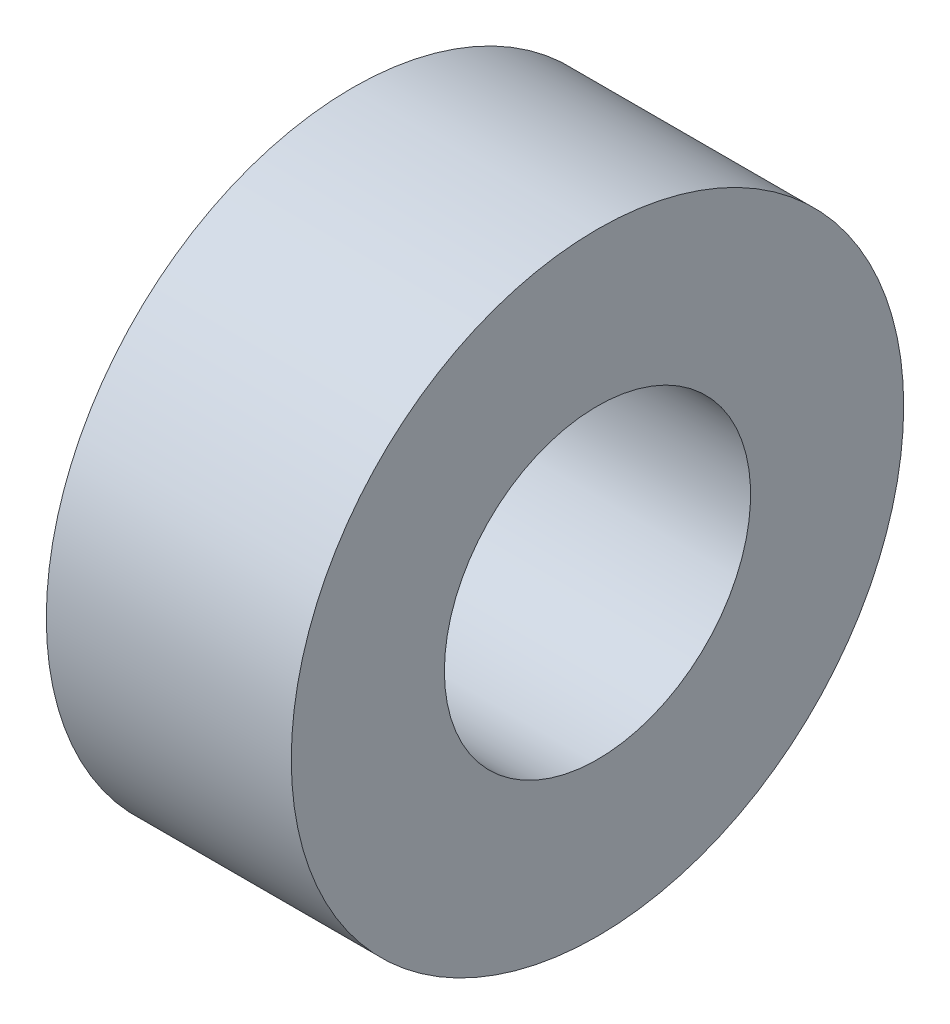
from build123d import *

# Parameters (mm, degrees)
ESQUISSE1_W = 4
ESQUISSE1_H = 2.5


with BuildPart() as part:
    # Esquisse1 → Base-R_volution (revolve)
    with BuildSketch(Plane.XY, mode=Mode.PRIVATE) as base_r_volution_sk:
        with Locations((2, 3.75)):
            Rectangle(ESQUISSE1_W, ESQUISSE1_H)
    revolve(base_r_volution_sk.sketch.rotate(Axis((-2, 0, 0), (1, 0, 0)), 90), axis=Axis((-2, 0, 0), (1, 0, 0)))


solid = part.part
